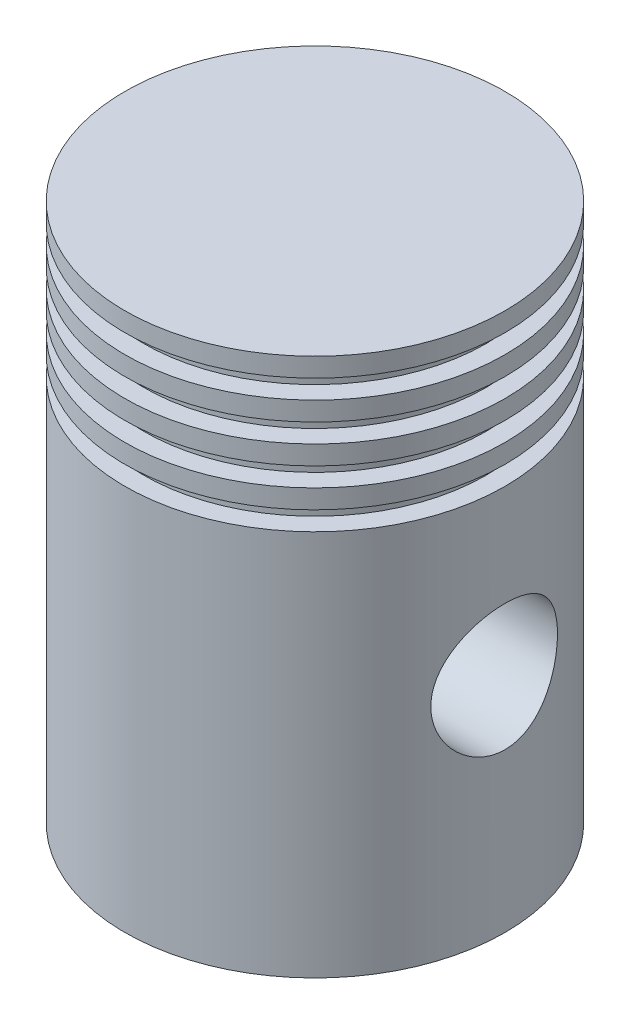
from build123d import *

# Parameters (mm, degrees)
BOSS_EXTRUDE2_REACH                  = 97
BOSS_EXTRUDE2_END_RADIUS             = 24
SKETCH2_R                            = 13
BOSS_EXTRUDE2_DIRECTION_2_REACH      = 97
BOSS_EXTRUDE2_DIRECTION_2_END_RADIUS = 24
CUT_EXTRUDE1_DEPTH                   = 96
CUT_EXTRUDE1_DEPTH_BACK              = 96
SKETCH3_R                            = 10
CUT_EXTRUDE2_DEPTH                   = 50
CUT_EXTRUDE2_DEPTH_BACK              = 96.000000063
SKETCH4_W                            = 20
SKETCH4_H                            = 26


with BuildPart() as part:
    # Sketch1 → Revolve1 (revolve)
    with BuildSketch(Plane.XY):
        Polygon((0, 85), (30, 85), (30, 82), (27, 82), (27, 79), (30, 79), (30, 76), (27, 76), (27, 73), (30, 73), (30, 70), (27, 70), (27, 67), (30, 67), (30, 64), (27, 64), (27, 61), (30, 61), (30, 0), (24, 0), (24, 73), (0, 73), align=None)
    revolve(axis=Axis((0, -1952.066030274, 0), (0, 1, 0)))

    # Boss-Extrude2: up to this cylinder (the profile starts inside it)
    boss_extrude2_end = Plane(origin=(0, 35, 0), z_dir=(0, -1, 0)) * Cylinder(BOSS_EXTRUDE2_END_RADIUS, 243, mode=Mode.PRIVATE)
    # Sketch2 → Boss-Extrude2 (add, up to the surface)
    with BuildSketch(Plane(origin=(0, 0, 0), x_dir=(0, 0, -1), z_dir=(1, 0, 0)), mode=Mode.PRIVATE) as boss_extrude2_sk1:
        with Locations((0, 35)):
            Circle(SKETCH2_R)
    boss_extrude2_tool1 = extrude(boss_extrude2_sk1.sketch, amount=BOSS_EXTRUDE2_REACH, mode=Mode.PRIVATE) & boss_extrude2_end
    add(boss_extrude2_tool1.solids().sort_by_distance((0, 35, 0))[0])

    # Boss-Extrude2 direction 2: up to this cylinder (the profile starts inside it)
    boss_extrude2_direction_2_end = Plane(origin=(0, 35, 0), z_dir=(0, -1, 0)) * Cylinder(BOSS_EXTRUDE2_DIRECTION_2_END_RADIUS, 243, mode=Mode.PRIVATE)
    # Sketch2 → Boss-Extrude2 direction 2 (add, up to the surface)
    with BuildSketch(Plane(origin=(0, 0, 0), x_dir=(0, 0, -1), z_dir=(1, 0, 0)), mode=Mode.PRIVATE) as boss_extrude2_direction_2_sk1:
        with Locations((0, 35)):
            Circle(SKETCH2_R)
    boss_extrude2_direction_2_tool1 = extrude(boss_extrude2_direction_2_sk1.sketch, amount=-BOSS_EXTRUDE2_DIRECTION_2_REACH, mode=Mode.PRIVATE) & boss_extrude2_direction_2_end
    add(boss_extrude2_direction_2_tool1.solids().sort_by_distance((0, 35, 0))[0])

    # Sketch3 → Cut-Extrude1 (cut, two sides: drawn at the far end of the back side and taken through both)
    with BuildSketch(Plane(origin=(0, 0, 0), x_dir=(0, 0, -1), z_dir=(1, 0, 0)).offset(-CUT_EXTRUDE1_DEPTH_BACK)):
        with Locations(Location((0, 35, 0), (0, 0, 270))):
            Circle(SKETCH3_R)
    extrude(amount=CUT_EXTRUDE1_DEPTH + CUT_EXTRUDE1_DEPTH_BACK, mode=Mode.SUBTRACT)

    # Sketch4 → Cut-Extrude2 (cut, two sides: drawn at the far end of the back side and taken through both)
    with BuildSketch(Plane(origin=(0, 0, 0), x_dir=(1, 0, 0), z_dir=(0, 1, 0)).offset(-CUT_EXTRUDE2_DEPTH_BACK)):
        Rectangle(SKETCH4_W, SKETCH4_H)
    extrude(amount=CUT_EXTRUDE2_DEPTH + CUT_EXTRUDE2_DEPTH_BACK, mode=Mode.SUBTRACT)


solid = part.part
